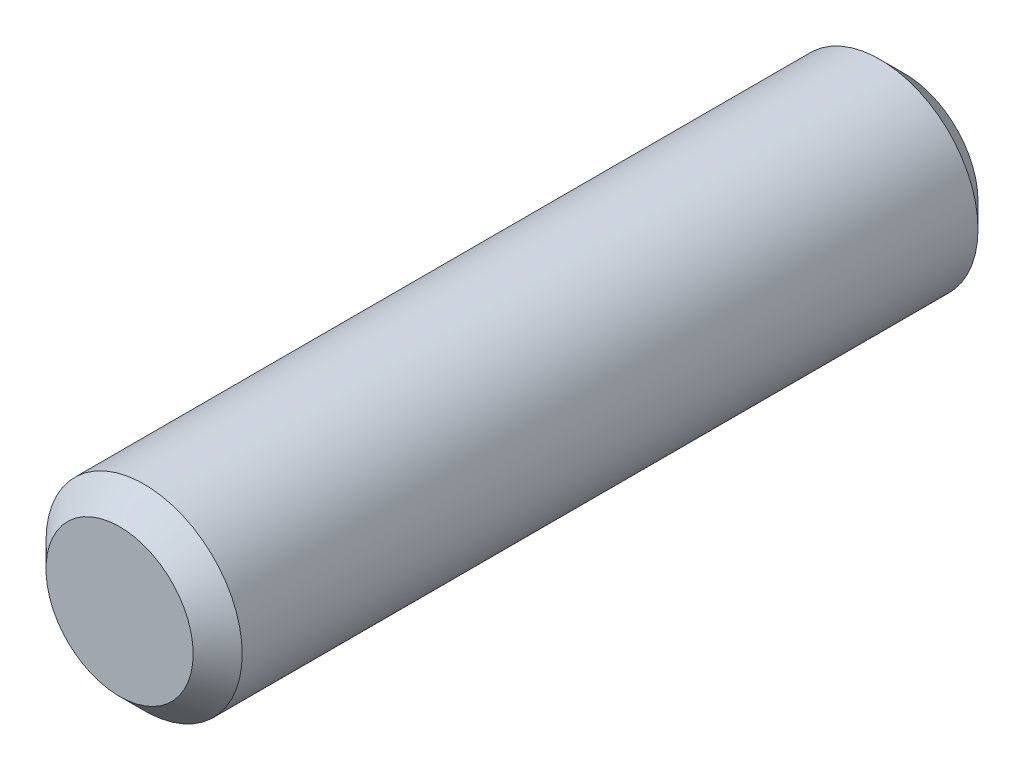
ISO-10303-21;
HEADER;
FILE_DESCRIPTION(('STEP AP214'),'2;1');
FILE_NAME('part.step','',(''),(''),'','','');
FILE_SCHEMA(('AUTOMOTIVE_DESIGN { 1 0 10303 214 1 1 1 1 }'));
ENDSEC;
DATA;
#1=APPLICATION_CONTEXT('core data for automotive mechanical design processes');
#2=APPLICATION_PROTOCOL_DEFINITION('international standard','automotive_design',2000,#1);
#3=PRODUCT_CONTEXT('',#1,'mechanical');
#4=PRODUCT('Part','Part','',(#3));
#5=PRODUCT_RELATED_PRODUCT_CATEGORY('part','',(#4));
#6=PRODUCT_DEFINITION_FORMATION('','',#4);
#7=PRODUCT_DEFINITION_CONTEXT('part definition',#1,'design');
#8=PRODUCT_DEFINITION('design','',#6,#7);
#9=PRODUCT_DEFINITION_SHAPE('','',#8);
#10=(LENGTH_UNIT() NAMED_UNIT(*) SI_UNIT(.MILLI.,.METRE.));
#11=(NAMED_UNIT(*) PLANE_ANGLE_UNIT() SI_UNIT($,.RADIAN.));
#12=(NAMED_UNIT(*) SI_UNIT($,.STERADIAN.) SOLID_ANGLE_UNIT());
#13=UNCERTAINTY_MEASURE_WITH_UNIT(LENGTH_MEASURE(1.E-05),#10,'distance_accuracy_value','');
#14=(GEOMETRIC_REPRESENTATION_CONTEXT(3) GLOBAL_UNCERTAINTY_ASSIGNED_CONTEXT((#13)) GLOBAL_UNIT_ASSIGNED_CONTEXT((#10,
#11,#12)) REPRESENTATION_CONTEXT('',''));
#15=CARTESIAN_POINT('',(0.,0.,0.));
#16=DIRECTION('',(0.,0.,1.));
#17=DIRECTION('',(1.,0.,0.));
#18=AXIS2_PLACEMENT_3D('',#15,#16,#17);
#19=CARTESIAN_POINT('',(0.,0.,16.));
#20=DIRECTION('',(0.,0.,-1.));
#21=DIRECTION('',(-1.,0.,0.));
#22=AXIS2_PLACEMENT_3D('',#19,#20,#21);
#23=CYLINDRICAL_SURFACE('',#22,2.);
#24=CARTESIAN_POINT('',(0.,0.,0.500000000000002));
#25=DIRECTION('',(0.,0.,1.));
#26=DIRECTION('',(1.,0.,0.));
#27=AXIS2_PLACEMENT_3D('',#24,#25,#26);
#28=CIRCLE('',#27,2.);
#29=CARTESIAN_POINT('',(2.,0.,0.500000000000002));
#30=VERTEX_POINT('',#29);
#31=EDGE_CURVE('E42',#30,#30,#28,.T.);
#32=ORIENTED_EDGE('',*,*,#31,.T.);
#33=EDGE_LOOP('',(#32));
#34=FACE_BOUND('',#33,.T.);
#35=CARTESIAN_POINT('',(0.,0.,15.5));
#36=DIRECTION('',(0.,0.,1.));
#37=DIRECTION('',(1.,0.,0.));
#38=AXIS2_PLACEMENT_3D('',#35,#36,#37);
#39=CIRCLE('',#38,2.);
#40=CARTESIAN_POINT('',(2.,0.,15.5));
#41=VERTEX_POINT('',#40);
#42=EDGE_CURVE('E46',#41,#41,#39,.F.);
#43=ORIENTED_EDGE('',*,*,#42,.T.);
#44=EDGE_LOOP('',(#43));
#45=FACE_BOUND('',#44,.T.);
#46=ADVANCED_FACE('F31',(#34,#45),#23,.T.);
#47=CARTESIAN_POINT('',(0.,0.,16.));
#48=DIRECTION('',(0.,0.,1.));
#49=DIRECTION('',(1.,0.,0.));
#50=AXIS2_PLACEMENT_3D('',#47,#48,#49);
#51=PLANE('',#50);
#52=CARTESIAN_POINT('',(0.,0.,16.));
#53=DIRECTION('',(0.,0.,1.));
#54=DIRECTION('',(1.,0.,0.));
#55=AXIS2_PLACEMENT_3D('',#52,#53,#54);
#56=CIRCLE('',#55,1.5);
#57=CARTESIAN_POINT('',(1.5,0.,16.));
#58=VERTEX_POINT('',#57);
#59=EDGE_CURVE('E10',#58,#58,#56,.T.);
#60=ORIENTED_EDGE('',*,*,#59,.T.);
#61=EDGE_LOOP('',(#60));
#62=FACE_BOUND('',#61,.T.);
#63=ADVANCED_FACE('F62',(#62),#51,.T.);
#64=CARTESIAN_POINT('',(0.,0.,0.));
#65=DIRECTION('',(0.,0.,1.));
#66=DIRECTION('',(1.,0.,0.));
#67=AXIS2_PLACEMENT_3D('',#64,#65,#66);
#68=PLANE('',#67);
#69=CARTESIAN_POINT('',(0.,0.,0.));
#70=DIRECTION('',(0.,0.,1.));
#71=DIRECTION('',(1.,0.,0.));
#72=AXIS2_PLACEMENT_3D('',#69,#70,#71);
#73=CIRCLE('',#72,1.49999999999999);
#74=CARTESIAN_POINT('',(1.49999999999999,0.,0.));
#75=VERTEX_POINT('',#74);
#76=EDGE_CURVE('E38',#75,#75,#73,.F.);
#77=ORIENTED_EDGE('',*,*,#76,.T.);
#78=EDGE_LOOP('',(#77));
#79=FACE_BOUND('',#78,.T.);
#80=ADVANCED_FACE('F59',(#79),#68,.F.);
#81=CARTESIAN_POINT('',(0.,0.,0.500000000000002));
#82=DIRECTION('',(0.,0.,1.));
#83=DIRECTION('',(1.,0.,0.));
#84=AXIS2_PLACEMENT_3D('',#81,#82,#83);
#85=CONICAL_SURFACE('',#84,2.,0.785398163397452);
#86=ORIENTED_EDGE('',*,*,#76,.F.);
#87=EDGE_LOOP('',(#86));
#88=FACE_BOUND('',#87,.T.);
#89=ORIENTED_EDGE('',*,*,#31,.F.);
#90=EDGE_LOOP('',(#89));
#91=FACE_BOUND('',#90,.T.);
#92=ADVANCED_FACE('F55',(#88,#91),#85,.T.);
#93=CARTESIAN_POINT('',(0.,0.,16.));
#94=DIRECTION('',(0.,0.,-1.));
#95=DIRECTION('',(-1.,0.,0.));
#96=AXIS2_PLACEMENT_3D('',#93,#94,#95);
#97=CONICAL_SURFACE('',#96,1.5,0.785398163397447);
#98=ORIENTED_EDGE('',*,*,#42,.F.);
#99=EDGE_LOOP('',(#98));
#100=FACE_BOUND('',#99,.T.);
#101=ORIENTED_EDGE('',*,*,#59,.F.);
#102=EDGE_LOOP('',(#101));
#103=FACE_BOUND('',#102,.T.);
#104=ADVANCED_FACE('F33',(#100,#103),#97,.T.);
#105=CLOSED_SHELL('',(#46,#63,#80,#92,#104));
#106=MANIFOLD_SOLID_BREP('B2',#105);
#107=ADVANCED_BREP_SHAPE_REPRESENTATION('',(#18,#106),#14);
#108=SHAPE_DEFINITION_REPRESENTATION(#9,#107);
ENDSEC;
END-ISO-10303-21;
